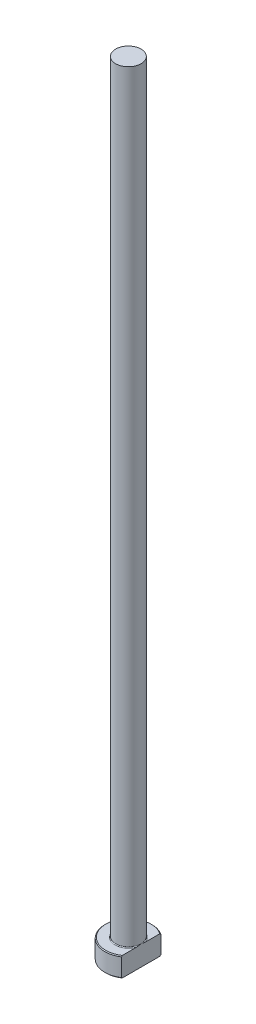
ISO-10303-21;
HEADER;
FILE_DESCRIPTION(('STEP AP214'),'2;1');
FILE_NAME('part.step','',(''),(''),'','','');
FILE_SCHEMA(('AUTOMOTIVE_DESIGN { 1 0 10303 214 1 1 1 1 }'));
ENDSEC;
DATA;
#1=APPLICATION_CONTEXT('core data for automotive mechanical design processes');
#2=APPLICATION_PROTOCOL_DEFINITION('international standard','automotive_design',2000,#1);
#3=PRODUCT_CONTEXT('',#1,'mechanical');
#4=PRODUCT('Part','Part','',(#3));
#5=PRODUCT_RELATED_PRODUCT_CATEGORY('part','',(#4));
#6=PRODUCT_DEFINITION_FORMATION('','',#4);
#7=PRODUCT_DEFINITION_CONTEXT('part definition',#1,'design');
#8=PRODUCT_DEFINITION('design','',#6,#7);
#9=PRODUCT_DEFINITION_SHAPE('','',#8);
#10=(LENGTH_UNIT() NAMED_UNIT(*) SI_UNIT(.MILLI.,.METRE.));
#11=(NAMED_UNIT(*) PLANE_ANGLE_UNIT() SI_UNIT($,.RADIAN.));
#12=(NAMED_UNIT(*) SI_UNIT($,.STERADIAN.) SOLID_ANGLE_UNIT());
#13=UNCERTAINTY_MEASURE_WITH_UNIT(LENGTH_MEASURE(1.E-05),#10,'distance_accuracy_value','');
#14=(GEOMETRIC_REPRESENTATION_CONTEXT(3) GLOBAL_UNCERTAINTY_ASSIGNED_CONTEXT((#13)) GLOBAL_UNIT_ASSIGNED_CONTEXT((#10,
#11,#12)) REPRESENTATION_CONTEXT('',''));
#15=CARTESIAN_POINT('',(0.,0.,0.));
#16=DIRECTION('',(0.,0.,1.));
#17=DIRECTION('',(1.,0.,0.));
#18=AXIS2_PLACEMENT_3D('',#15,#16,#17);
#19=CARTESIAN_POINT('',(0.,0.,0.));
#20=DIRECTION('',(0.,-1.,0.));
#21=DIRECTION('',(0.,0.,-1.));
#22=AXIS2_PLACEMENT_3D('',#19,#20,#21);
#23=PLANE('',#22);
#24=CARTESIAN_POINT('',(0.,0.,0.));
#25=DIRECTION('',(0.,-1.,0.));
#26=DIRECTION('',(0.,0.,-1.));
#27=AXIS2_PLACEMENT_3D('',#24,#25,#26);
#28=CIRCLE('',#27,5.79999999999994);
#29=CARTESIAN_POINT('',(3.24999999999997,0.,4.80390466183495));
#30=VERTEX_POINT('',#29);
#31=CARTESIAN_POINT('',(3.24999999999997,0.,-4.80390466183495));
#32=VERTEX_POINT('',#31);
#33=EDGE_CURVE('E98',#30,#32,#28,.T.);
#34=ORIENTED_EDGE('',*,*,#33,.T.);
#35=DIRECTION('',(0.,0.,1.));
#36=VECTOR('',#35,1.);
#37=CARTESIAN_POINT('',(3.24999999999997,0.,-5.04356025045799));
#38=LINE('',#37,#36);
#39=EDGE_CURVE('E83',#32,#30,#38,.T.);
#40=ORIENTED_EDGE('',*,*,#39,.T.);
#41=EDGE_LOOP('',(#34,#40));
#42=FACE_BOUND('',#41,.T.);
#43=ADVANCED_FACE('F32',(#42),#23,.T.);
#44=CARTESIAN_POINT('',(0.,259.958771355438,0.));
#45=DIRECTION('',(0.,1.,0.));
#46=DIRECTION('',(0.,0.,1.));
#47=AXIS2_PLACEMENT_3D('',#44,#45,#46);
#48=CYLINDRICAL_SURFACE('',#47,5.99999999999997);
#49=CARTESIAN_POINT('',(0.,4.80000000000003,0.));
#50=DIRECTION('',(0.,1.,0.));
#51=DIRECTION('',(0.,0.,1.));
#52=AXIS2_PLACEMENT_3D('',#49,#50,#51);
#53=CIRCLE('',#52,5.99999999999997);
#54=CARTESIAN_POINT('',(3.24999999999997,4.80000000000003,5.04356025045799));
#55=VERTEX_POINT('',#54);
#56=CARTESIAN_POINT('',(3.24999999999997,4.80000000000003,-5.04356025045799));
#57=VERTEX_POINT('',#56);
#58=EDGE_CURVE('E104',#55,#57,#53,.F.);
#59=ORIENTED_EDGE('',*,*,#58,.T.);
#60=DIRECTION('',(0.,-1.,0.));
#61=VECTOR('',#60,1.);
#62=CARTESIAN_POINT('',(3.24999999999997,200.,-5.04356025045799));
#63=LINE('',#62,#61);
#64=CARTESIAN_POINT('',(3.24999999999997,0.200000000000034,-5.04356025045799));
#65=VERTEX_POINT('',#64);
#66=EDGE_CURVE('E183',#57,#65,#63,.T.);
#67=ORIENTED_EDGE('',*,*,#66,.T.);
#68=CARTESIAN_POINT('',(0.,0.200000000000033,0.));
#69=DIRECTION('',(0.,-1.,0.));
#70=DIRECTION('',(0.,0.,-1.));
#71=AXIS2_PLACEMENT_3D('',#68,#69,#70);
#72=CIRCLE('',#71,5.99999999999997);
#73=CARTESIAN_POINT('',(3.24999999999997,0.200000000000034,5.04356025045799));
#74=VERTEX_POINT('',#73);
#75=EDGE_CURVE('E100',#65,#74,#72,.F.);
#76=ORIENTED_EDGE('',*,*,#75,.T.);
#77=DIRECTION('',(0.,-1.,0.));
#78=VECTOR('',#77,1.);
#79=CARTESIAN_POINT('',(3.24999999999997,200.,5.04356025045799));
#80=LINE('',#79,#78);
#81=EDGE_CURVE('E93',#55,#74,#80,.T.);
#82=ORIENTED_EDGE('',*,*,#81,.F.);
#83=EDGE_LOOP('',(#59,#67,#76,#82));
#84=FACE_BOUND('',#83,.T.);
#85=ADVANCED_FACE('F158',(#84),#48,.T.);
#86=CARTESIAN_POINT('',(-5.99999999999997,5.,0.));
#87=DIRECTION('',(0.,1.,0.));
#88=DIRECTION('',(0.,0.,1.));
#89=AXIS2_PLACEMENT_3D('',#86,#87,#88);
#90=PLANE('',#89);
#91=CARTESIAN_POINT('',(0.,5.,0.));
#92=DIRECTION('',(0.,1.,0.));
#93=DIRECTION('',(0.,0.,1.));
#94=AXIS2_PLACEMENT_3D('',#91,#92,#93);
#95=CIRCLE('',#94,5.79999999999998);
#96=CARTESIAN_POINT('',(3.24999999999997,5.,-4.80390466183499));
#97=VERTEX_POINT('',#96);
#98=CARTESIAN_POINT('',(3.24999999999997,5.,4.80390466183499));
#99=VERTEX_POINT('',#98);
#100=EDGE_CURVE('E178',#97,#99,#95,.T.);
#101=ORIENTED_EDGE('',*,*,#100,.T.);
#102=DIRECTION('',(0.,0.,-1.));
#103=VECTOR('',#102,1.);
#104=CARTESIAN_POINT('',(3.24999999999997,5.,0.));
#105=LINE('',#104,#103);
#106=CARTESIAN_POINT('',(3.24999999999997,4.99999999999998,1.15758369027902));
#107=VERTEX_POINT('',#106);
#108=EDGE_CURVE('E57',#99,#107,#105,.T.);
#109=ORIENTED_EDGE('',*,*,#108,.T.);
#110=CARTESIAN_POINT('',(0.,5.,0.));
#111=DIRECTION('',(0.,1.,0.));
#112=DIRECTION('',(0.,0.,1.));
#113=AXIS2_PLACEMENT_3D('',#110,#111,#112);
#114=CIRCLE('',#113,3.44999999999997);
#115=CARTESIAN_POINT('',(3.24999999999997,4.99999999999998,-1.15758369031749));
#116=VERTEX_POINT('',#115);
#117=EDGE_CURVE('E107',#107,#116,#114,.F.);
#118=ORIENTED_EDGE('',*,*,#117,.T.);
#119=EDGE_CURVE('E136',#116,#97,#105,.T.);
#120=ORIENTED_EDGE('',*,*,#119,.T.);
#121=EDGE_LOOP('',(#101,#109,#118,#120));
#122=FACE_BOUND('',#121,.T.);
#123=ADVANCED_FACE('F147',(#122),#90,.T.);
#124=CARTESIAN_POINT('',(0.,5.,0.));
#125=DIRECTION('',(0.,-1.,0.));
#126=DIRECTION('',(0.,0.,-1.));
#127=AXIS2_PLACEMENT_3D('',#124,#125,#126);
#128=CONICAL_SURFACE('',#127,5.79999999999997,0.785398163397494);
#129=ORIENTED_EDGE('',*,*,#58,.F.);
#130=CARTESIAN_POINT('',(3.24999999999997,-0.763340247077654,11.097222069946));
#131=CARTESIAN_POINT('',(3.24999999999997,-0.555249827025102,10.8803821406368));
#132=CARTESIAN_POINT('',(3.24999999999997,-0.347401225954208,10.6633095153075));
#133=CARTESIAN_POINT('',(3.24999999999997,0.0676973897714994,10.2285893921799));
#134=CARTESIAN_POINT('',(3.24999999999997,0.274947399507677,10.010941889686));
#135=CARTESIAN_POINT('',(3.24999999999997,0.68879015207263,9.5749031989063));
#136=CARTESIAN_POINT('',(3.24999999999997,0.895382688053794,9.35651181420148));
#137=CARTESIAN_POINT('',(3.24999999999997,1.30769007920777,8.91890298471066));
#138=CARTESIAN_POINT('',(3.24999999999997,1.51340493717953,8.69968554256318));
#139=CARTESIAN_POINT('',(3.24999999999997,1.92056067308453,8.26365159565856));
#140=CARTESIAN_POINT('',(3.24999999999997,2.1220182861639,8.04685072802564));
#141=CARTESIAN_POINT('',(3.24999999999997,2.52361432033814,7.61203089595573));
#142=CARTESIAN_POINT('',(3.24999999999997,2.72375274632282,7.39401193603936));
#143=CARTESIAN_POINT('',(3.24999999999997,3.1223203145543,6.95646589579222));
#144=CARTESIAN_POINT('',(3.24999999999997,3.32074966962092,6.73693900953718));
#145=CARTESIAN_POINT('',(3.24999999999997,3.71541049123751,6.2959206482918));
#146=CARTESIAN_POINT('',(3.24999999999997,3.91164199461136,6.07442920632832));
#147=CARTESIAN_POINT('',(3.24999999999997,4.26795525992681,5.66684646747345));
#148=CARTESIAN_POINT('',(3.24999999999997,4.42849662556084,5.48115751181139));
#149=CARTESIAN_POINT('',(3.24999999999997,4.74694681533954,5.10749706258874));
#150=CARTESIAN_POINT('',(3.24999999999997,4.9048553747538,4.91952534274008));
#151=CARTESIAN_POINT('',(3.24999999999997,5.21865243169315,4.53879767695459));
#152=CARTESIAN_POINT('',(3.24999999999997,5.37450606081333,4.34601291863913));
#153=CARTESIAN_POINT('',(3.24999999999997,5.68118935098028,3.95653844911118));
#154=CARTESIAN_POINT('',(3.24999999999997,5.83202036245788,3.75984981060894));
#155=CARTESIAN_POINT('',(3.24999999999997,6.05390638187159,3.4594085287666));
#156=CARTESIAN_POINT('',(3.24999999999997,6.12763821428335,3.35763377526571));
#157=CARTESIAN_POINT('',(3.24999999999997,6.27282302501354,3.15247478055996));
#158=CARTESIAN_POINT('',(3.24999999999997,6.3442761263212,3.04909062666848));
#159=CARTESIAN_POINT('',(3.24999999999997,6.48448981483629,2.84026816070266));
#160=CARTESIAN_POINT('',(3.24999999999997,6.55324599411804,2.7348268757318));
#161=CARTESIAN_POINT('',(3.24999999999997,6.68723865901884,2.52174014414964));
#162=CARTESIAN_POINT('',(3.24999999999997,6.75247550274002,2.4140949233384));
#163=CARTESIAN_POINT('',(3.24999999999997,6.87780644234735,2.19745654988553));
#164=CARTESIAN_POINT('',(3.24999999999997,6.93795082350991,2.08849289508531));
#165=CARTESIAN_POINT('',(3.24999999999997,7.05273719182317,1.86772106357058));
#166=CARTESIAN_POINT('',(3.24999999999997,7.10737807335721,1.75591232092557));
#167=CARTESIAN_POINT('',(3.24999999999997,7.26056715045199,1.41626442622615));
#168=CARTESIAN_POINT('',(3.24999999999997,7.34888232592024,1.1833811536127));
#169=CARTESIAN_POINT('',(3.24999999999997,7.44593218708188,0.835575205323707));
#170=CARTESIAN_POINT('',(3.24999999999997,7.4718222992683,0.725406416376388));
#171=CARTESIAN_POINT('',(3.24999999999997,7.51310579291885,0.5030789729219));
#172=CARTESIAN_POINT('',(3.24999999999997,7.52850034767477,0.390920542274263));
#173=CARTESIAN_POINT('',(3.24999999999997,7.54767882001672,0.166070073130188));
#174=CARTESIAN_POINT('',(3.24999999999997,7.5515109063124,0.0533822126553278));
#175=CARTESIAN_POINT('',(3.24999999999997,7.54741082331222,-0.171782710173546));
#176=CARTESIAN_POINT('',(3.24999999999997,7.5394779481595,-0.28425975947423));
#177=CARTESIAN_POINT('',(3.24999999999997,7.51253523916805,-0.507025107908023));
#178=CARTESIAN_POINT('',(3.24999999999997,7.4936058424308,-0.617323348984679));
#179=CARTESIAN_POINT('',(3.24999999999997,7.44595440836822,-0.835762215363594));
#180=CARTESIAN_POINT('',(3.24999999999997,7.41723093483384,-0.943902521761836));
#181=CARTESIAN_POINT('',(3.24999999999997,7.35127840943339,-1.15830231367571));
#182=CARTESIAN_POINT('',(3.24999999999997,7.31399439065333,-1.26454464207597));
#183=CARTESIAN_POINT('',(3.24999999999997,7.23254630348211,-1.47430332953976));
#184=CARTESIAN_POINT('',(3.24999999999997,7.18838353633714,-1.57782019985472));
#185=CARTESIAN_POINT('',(3.24999999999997,7.09672451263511,-1.7774238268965));
#186=CARTESIAN_POINT('',(3.24999999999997,7.04948595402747,-1.87363004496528));
#187=CARTESIAN_POINT('',(3.24999999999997,6.95089019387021,-2.06391775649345));
#188=CARTESIAN_POINT('',(3.24999999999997,6.89953216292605,-2.15799881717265));
#189=CARTESIAN_POINT('',(3.24999999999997,6.74036914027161,-2.43755985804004));
#190=CARTESIAN_POINT('',(3.24999999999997,6.62755752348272,-2.62018561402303));
#191=CARTESIAN_POINT('',(3.24999999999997,6.39256809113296,-2.98019331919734));
#192=CARTESIAN_POINT('',(3.24999999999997,6.27035601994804,-3.15755247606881));
#193=CARTESIAN_POINT('',(3.24999999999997,6.0197011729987,-3.50765833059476));
#194=CARTESIAN_POINT('',(3.24999999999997,5.8912614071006,-3.68040719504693));
#195=CARTESIAN_POINT('',(3.24999999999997,5.62829316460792,-4.02448614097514));
#196=CARTESIAN_POINT('',(3.24999999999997,5.49371006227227,-4.19577421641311));
#197=CARTESIAN_POINT('',(3.24999999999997,5.22110967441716,-4.5356145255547));
#198=CARTESIAN_POINT('',(3.24999999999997,5.08309204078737,-4.70416647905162));
#199=CARTESIAN_POINT('',(3.24999999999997,4.80478673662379,-5.03871726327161));
#200=CARTESIAN_POINT('',(3.24999999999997,4.66450509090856,-5.20472111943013));
#201=CARTESIAN_POINT('',(3.24999999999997,4.38193422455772,-5.53501285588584));
#202=CARTESIAN_POINT('',(3.24999999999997,4.23964496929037,-5.69930070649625));
#203=CARTESIAN_POINT('',(3.24999999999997,3.89726045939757,-6.09077577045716));
#204=CARTESIAN_POINT('',(3.24999999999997,3.69642117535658,-6.31731165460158));
#205=CARTESIAN_POINT('',(3.24999999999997,3.29246897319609,-6.76834962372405));
#206=CARTESIAN_POINT('',(3.24999999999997,3.08935601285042,-6.99285167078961));
#207=CARTESIAN_POINT('',(3.24999999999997,2.68122553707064,-7.44046009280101));
#208=CARTESIAN_POINT('',(3.24999999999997,2.47620657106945,-7.66356514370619));
#209=CARTESIAN_POINT('',(3.24999999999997,2.06481442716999,-8.10852300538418));
#210=CARTESIAN_POINT('',(3.24999999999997,1.85844124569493,-8.33037581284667));
#211=CARTESIAN_POINT('',(3.24999999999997,1.45176082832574,-8.76543407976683));
#212=CARTESIAN_POINT('',(3.24999999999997,1.25149010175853,-8.9786736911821));
#213=CARTESIAN_POINT('',(3.24999999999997,0.850131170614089,-9.40438299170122));
#214=CARTESIAN_POINT('',(3.24999999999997,0.649042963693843,-9.61685267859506));
#215=CARTESIAN_POINT('',(3.24999999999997,0.246391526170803,-10.0409455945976));
#216=CARTESIAN_POINT('',(3.24999999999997,0.0448289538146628,-10.2525694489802));
#217=CARTESIAN_POINT('',(3.24999999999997,-0.358859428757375,-10.6752763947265));
#218=CARTESIAN_POINT('',(3.24999999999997,-0.560985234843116,-10.8863594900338));
#219=CARTESIAN_POINT('',(3.24999999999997,-0.763340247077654,-11.097222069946));
#220=B_SPLINE_CURVE_WITH_KNOTS('',3,(#130,#131,#132,#133,#134,#135,#136,#137,#138,#139,#140,
#141,#142,#143,#144,#145,#146,#147,#148,#149,#150,#151,#152,#153,#154,#155,#156,#157,#158,#159,
#160,#161,#162,#163,#164,#165,#166,#167,#168,#169,#170,#171,#172,#173,#174,#175,#176,#177,#178,
#179,#180,#181,#182,#183,#184,#185,#186,#187,#188,#189,#190,#191,#192,#193,#194,#195,#196,#197,
#198,#199,#200,#201,#202,#203,#204,#205,#206,#207,#208,#209,#210,#211,#212,#213,#214,#215,#216,
#217,#218,#219),.UNSPECIFIED.,.F.,.F.,(4,2,2,2,2,2,2,2,2,2,2,2,2,2,2,2,2,2,2,2,2,2,2,2,2,2,2,2,
2,2,2,2,2,2,2,2,2,2,2,2,2,2,2,2,4),(0.,0.901604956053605,1.80321729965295,2.70508973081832,
3.60695928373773,4.49481204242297,5.3826615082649,6.27039876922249,7.15812113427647,
7.89450333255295,8.63095913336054,9.37461869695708,10.1180766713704,10.4950808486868,
10.8720646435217,11.2496408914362,11.6271786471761,12.0003984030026,12.3736929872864,
13.117405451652,13.4565058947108,13.795568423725,14.1332164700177,14.4708847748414,
14.8061136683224,15.1413917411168,15.4788860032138,15.8163164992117,16.1377318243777,
16.4592120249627,17.1027431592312,17.7487418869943,18.3944314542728,19.0478814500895,
19.7013979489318,20.3533948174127,21.0054029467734,21.9136176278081,22.8218492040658,
23.7308402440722,24.6398336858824,25.5174503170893,26.3950694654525,27.2718289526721,
28.1485820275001),.UNSPECIFIED.);
#221=EDGE_CURVE('E135',#55,#99,#220,.T.);
#222=ORIENTED_EDGE('',*,*,#221,.T.);
#223=ORIENTED_EDGE('',*,*,#100,.F.);
#224=EDGE_CURVE('E127',#97,#57,#220,.T.);
#225=ORIENTED_EDGE('',*,*,#224,.T.);
#226=EDGE_LOOP('',(#129,#222,#223,#225));
#227=FACE_BOUND('',#226,.T.);
#228=ADVANCED_FACE('F143',(#227),#128,.T.);
#229=CARTESIAN_POINT('',(0.,0.200000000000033,0.));
#230=DIRECTION('',(0.,1.,0.));
#231=DIRECTION('',(0.,0.,1.));
#232=AXIS2_PLACEMENT_3D('',#229,#230,#231);
#233=CONICAL_SURFACE('',#232,5.99999999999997,0.785398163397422);
#234=ORIENTED_EDGE('',*,*,#75,.F.);
#235=CARTESIAN_POINT('',(3.24999999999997,5.76334024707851,-11.0972220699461));
#236=CARTESIAN_POINT('',(3.24999999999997,5.55524982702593,-10.8803821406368));
#237=CARTESIAN_POINT('',(3.24999999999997,5.347401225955,-10.6633095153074));
#238=CARTESIAN_POINT('',(3.24999999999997,4.93230261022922,-10.2285893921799));
#239=CARTESIAN_POINT('',(3.24999999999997,4.72505260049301,-10.0109418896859));
#240=CARTESIAN_POINT('',(3.24999999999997,4.31120984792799,-9.57490319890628));
#241=CARTESIAN_POINT('',(3.24999999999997,4.10461731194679,-9.35651181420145));
#242=CARTESIAN_POINT('',(3.24999999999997,3.69230992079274,-8.91890298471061));
#243=CARTESIAN_POINT('',(3.24999999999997,3.48659506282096,-8.69968554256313));
#244=CARTESIAN_POINT('',(3.24999999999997,3.07943932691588,-8.26365159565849));
#245=CARTESIAN_POINT('',(3.24999999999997,2.87798171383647,-8.04685072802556));
#246=CARTESIAN_POINT('',(3.24999999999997,2.47638567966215,-7.61203089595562));
#247=CARTESIAN_POINT('',(3.24999999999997,2.27624725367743,-7.39401193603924));
#248=CARTESIAN_POINT('',(3.24999999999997,1.87767968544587,-6.95646589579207));
#249=CARTESIAN_POINT('',(3.24999999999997,1.6792503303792,-6.73693900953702));
#250=CARTESIAN_POINT('',(3.24999999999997,1.28458950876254,-6.29592064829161));
#251=CARTESIAN_POINT('',(3.24999999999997,1.08835800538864,-6.07442920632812));
#252=CARTESIAN_POINT('',(3.24999999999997,0.732044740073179,-5.66684646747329));
#253=CARTESIAN_POINT('',(3.24999999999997,0.57150337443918,-5.48115751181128));
#254=CARTESIAN_POINT('',(3.24999999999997,0.253053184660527,-5.10749706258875));
#255=CARTESIAN_POINT('',(3.24999999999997,0.0951446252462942,-4.91952534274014));
#256=CARTESIAN_POINT('',(3.24999999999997,-0.218652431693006,-4.53879767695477));
#257=CARTESIAN_POINT('',(3.24999999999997,-0.374506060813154,-4.34601291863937));
#258=CARTESIAN_POINT('',(3.24999999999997,-0.681189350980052,-3.95653844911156));
#259=CARTESIAN_POINT('',(3.24999999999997,-0.832020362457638,-3.75984981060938));
#260=CARTESIAN_POINT('',(3.24999999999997,-1.05390638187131,-3.45940852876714));
#261=CARTESIAN_POINT('',(3.24999999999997,-1.12763821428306,-3.35763377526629));
#262=CARTESIAN_POINT('',(3.24999999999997,-1.27282302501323,-3.15247478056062));
#263=CARTESIAN_POINT('',(3.24999999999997,-1.34427612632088,-3.04909062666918));
#264=CARTESIAN_POINT('',(3.24999999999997,-1.48448981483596,-2.84026816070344));
#265=CARTESIAN_POINT('',(3.24999999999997,-1.5532459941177,-2.73482687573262));
#266=CARTESIAN_POINT('',(3.24999999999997,-1.6872386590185,-2.52174014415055));
#267=CARTESIAN_POINT('',(3.24999999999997,-1.75247550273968,-2.41409492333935));
#268=CARTESIAN_POINT('',(3.24999999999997,-1.87780644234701,-2.19745654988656));
#269=CARTESIAN_POINT('',(3.24999999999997,-1.93795082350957,-2.08849289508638));
#270=CARTESIAN_POINT('',(3.24999999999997,-2.05273719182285,-1.86772106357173));
#271=CARTESIAN_POINT('',(3.24999999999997,-2.10737807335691,-1.75591232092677));
#272=CARTESIAN_POINT('',(3.24999999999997,-2.26056715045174,-1.41626442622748));
#273=CARTESIAN_POINT('',(3.24999999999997,-2.34888232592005,-1.18338115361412));
#274=CARTESIAN_POINT('',(3.24999999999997,-2.44593218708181,-0.835575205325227));
#275=CARTESIAN_POINT('',(3.24999999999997,-2.47182229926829,-0.725406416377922));
#276=CARTESIAN_POINT('',(3.24999999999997,-2.51310579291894,-0.50307897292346));
#277=CARTESIAN_POINT('',(3.24999999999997,-2.52850034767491,-0.390920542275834));
#278=CARTESIAN_POINT('',(3.24999999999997,-2.54767882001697,-0.166070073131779));
#279=CARTESIAN_POINT('',(3.24999999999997,-2.5515109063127,-0.0533822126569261));
#280=CARTESIAN_POINT('',(3.24999999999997,-2.54741082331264,0.171782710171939));
#281=CARTESIAN_POINT('',(3.24999999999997,-2.53947794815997,0.284259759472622));
#282=CARTESIAN_POINT('',(3.24999999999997,-2.51253523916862,0.507025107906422));
#283=CARTESIAN_POINT('',(3.24999999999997,-2.49360584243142,0.617323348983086));
#284=CARTESIAN_POINT('',(3.24999999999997,-2.44595440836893,0.835762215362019));
#285=CARTESIAN_POINT('',(3.24999999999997,-2.41723093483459,0.943902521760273));
#286=CARTESIAN_POINT('',(3.24999999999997,-2.35127840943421,1.15830231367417));
#287=CARTESIAN_POINT('',(3.24999999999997,-2.31399439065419,1.26454464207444));
#288=CARTESIAN_POINT('',(3.24999999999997,-2.23254630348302,1.47430332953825));
#289=CARTESIAN_POINT('',(3.24999999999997,-2.18838353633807,1.57782019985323));
#290=CARTESIAN_POINT('',(3.24999999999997,-2.09672451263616,1.77742382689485));
#291=CARTESIAN_POINT('',(3.24999999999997,-2.04948595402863,1.87363004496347));
#292=CARTESIAN_POINT('',(3.24999999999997,-1.95089019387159,2.06391775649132));
#293=CARTESIAN_POINT('',(3.24999999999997,-1.89953216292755,2.15799881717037));
#294=CARTESIAN_POINT('',(3.24999999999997,-1.74036914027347,2.4375598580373));
#295=CARTESIAN_POINT('',(3.24999999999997,-1.62755752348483,2.62018561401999));
#296=CARTESIAN_POINT('',(3.24999999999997,-1.39256809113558,2.98019331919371));
#297=CARTESIAN_POINT('',(3.24999999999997,-1.27035601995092,3.15755247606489));
#298=CARTESIAN_POINT('',(3.24999999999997,-1.01970117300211,3.50765833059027));
#299=CARTESIAN_POINT('',(3.24999999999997,-0.891261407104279,3.68040719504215));
#300=CARTESIAN_POINT('',(3.24999999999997,-0.628293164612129,4.0244861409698));
#301=CARTESIAN_POINT('',(3.24999999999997,-0.493710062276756,4.19577421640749));
#302=CARTESIAN_POINT('',(3.24999999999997,-0.221109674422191,4.53561452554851));
#303=CARTESIAN_POINT('',(3.24999999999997,-0.0830920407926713,4.70416647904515));
#304=CARTESIAN_POINT('',(3.24999999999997,0.19521326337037,5.03871726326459));
#305=CARTESIAN_POINT('',(3.24999999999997,0.335494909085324,5.20472111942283));
#306=CARTESIAN_POINT('',(3.24999999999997,0.618065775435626,5.53501285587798));
#307=CARTESIAN_POINT('',(3.24999999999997,0.7603550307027,5.69930070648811));
#308=CARTESIAN_POINT('',(3.24999999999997,1.10273954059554,6.09077577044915));
#309=CARTESIAN_POINT('',(3.24999999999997,1.30357882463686,6.31731165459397));
#310=CARTESIAN_POINT('',(3.24999999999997,1.70753102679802,6.76834962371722));
#311=CARTESIAN_POINT('',(3.24999999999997,1.91064398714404,6.99285167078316));
#312=CARTESIAN_POINT('',(3.24999999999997,2.31877446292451,7.44046009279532));
#313=CARTESIAN_POINT('',(3.24999999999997,2.52379342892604,7.66356514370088));
#314=CARTESIAN_POINT('',(3.24999999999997,2.93518557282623,8.10852300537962));
#315=CARTESIAN_POINT('',(3.24999999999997,3.14155875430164,8.33037581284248));
#316=CARTESIAN_POINT('',(3.24999999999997,3.54823917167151,8.76543407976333));
#317=CARTESIAN_POINT('',(3.24999999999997,3.74850989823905,8.97867369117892));
#318=CARTESIAN_POINT('',(3.24999999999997,4.14986882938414,9.40438299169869));
#319=CARTESIAN_POINT('',(3.24999999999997,4.35095703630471,9.61685267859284));
#320=CARTESIAN_POINT('',(3.24999999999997,4.75360847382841,10.040945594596));
#321=CARTESIAN_POINT('',(3.24999999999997,4.95517104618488,10.252569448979));
#322=CARTESIAN_POINT('',(3.24999999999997,5.35885942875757,10.6752763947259));
#323=CARTESIAN_POINT('',(3.24999999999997,5.56098523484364,10.8863594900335));
#324=CARTESIAN_POINT('',(3.24999999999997,5.76334024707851,11.097222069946));
#325=B_SPLINE_CURVE_WITH_KNOTS('',3,(#235,#236,#237,#238,#239,#240,#241,#242,#243,#244,#245,
#246,#247,#248,#249,#250,#251,#252,#253,#254,#255,#256,#257,#258,#259,#260,#261,#262,#263,#264,
#265,#266,#267,#268,#269,#270,#271,#272,#273,#274,#275,#276,#277,#278,#279,#280,#281,#282,#283,
#284,#285,#286,#287,#288,#289,#290,#291,#292,#293,#294,#295,#296,#297,#298,#299,#300,#301,#302,
#303,#304,#305,#306,#307,#308,#309,#310,#311,#312,#313,#314,#315,#316,#317,#318,#319,#320,#321,
#322,#323,#324),.UNSPECIFIED.,.F.,.F.,(4,2,2,2,2,2,2,2,2,2,2,2,2,2,2,2,2,2,2,2,2,2,2,2,2,2,2,2,
2,2,2,2,2,2,2,2,2,2,2,2,2,2,2,2,4),(0.,0.901604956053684,1.80321729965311,2.70508973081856,
3.60695928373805,4.4948120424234,5.38266150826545,6.27039876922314,7.15812113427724,
7.89450333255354,8.63095913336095,9.3746186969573,10.1180766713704,10.4950808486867,
10.8720646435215,11.2496408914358,11.6271786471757,12.000398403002,12.3736929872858,
13.1174054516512,13.4565058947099,13.7955684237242,14.1332164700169,14.4708847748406,
14.8061136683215,15.1413917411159,15.478886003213,15.8163164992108,16.1377318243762,
16.4592120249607,17.1027431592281,17.74874188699,18.3944314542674,19.0478814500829,
19.701397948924,20.3533948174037,21.0054029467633,21.9136176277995,22.8218492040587,
23.7308402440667,24.6398336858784,25.5174503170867,26.3950694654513,27.2718289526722,
28.1485820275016),.UNSPECIFIED.);
#326=EDGE_CURVE('E86',#65,#32,#325,.T.);
#327=ORIENTED_EDGE('',*,*,#326,.T.);
#328=ORIENTED_EDGE('',*,*,#33,.F.);
#329=EDGE_CURVE('E89',#30,#74,#325,.T.);
#330=ORIENTED_EDGE('',*,*,#329,.T.);
#331=EDGE_LOOP('',(#234,#327,#328,#330));
#332=FACE_BOUND('',#331,.T.);
#333=ADVANCED_FACE('F97',(#332),#233,.T.);
#334=CARTESIAN_POINT('',(0.,5.19999999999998,0.));
#335=DIRECTION('',(0.,1.,0.));
#336=DIRECTION('',(0.,0.,1.));
#337=AXIS2_PLACEMENT_3D('',#334,#335,#336);
#338=TOROIDAL_SURFACE('',#337,3.44999999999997,0.2);
#339=CARTESIAN_POINT('',(3.24999999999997,5.19999999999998,0.));
#340=CARTESIAN_POINT('',(3.24999999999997,5.20000050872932,1.30593484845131E-10));
#341=CARTESIAN_POINT('',(3.24999999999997,5.20000101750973,-2.02989018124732E-07));
#342=CARTESIAN_POINT('',(3.24999999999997,5.20000196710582,-7.62846146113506E-07));
#343=CARTESIAN_POINT('',(3.24999999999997,5.20000239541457,-1.13332165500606E-06));
#344=CARTESIAN_POINT('',(3.24999999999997,5.20000328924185,-2.02149564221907E-06));
#345=CARTESIAN_POINT('',(3.24999999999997,5.20000374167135,-2.55359112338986E-06));
#346=CARTESIAN_POINT('',(3.24999999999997,5.20000454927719,-3.65434903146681E-06));
#347=CARTESIAN_POINT('',(3.24999999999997,5.20000490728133,-4.22110424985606E-06));
#348=CARTESIAN_POINT('',(3.24999999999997,5.20000624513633,-6.42540895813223E-06));
#349=CARTESIAN_POINT('',(3.24999999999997,5.20000715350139,-8.1091236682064E-06));
#350=CARTESIAN_POINT('',(3.24999999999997,5.20000863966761,-1.14364149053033E-05));
#351=CARTESIAN_POINT('',(3.24999999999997,5.20000923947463,-1.30705587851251E-05));
#352=CARTESIAN_POINT('',(3.24999999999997,5.20001177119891,-2.00139280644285E-05));
#353=CARTESIAN_POINT('',(3.24999999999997,5.20001367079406,-2.53379428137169E-05));
#354=CARTESIAN_POINT('',(3.24999999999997,5.20001645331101,-3.53765138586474E-05));
#355=CARTESIAN_POINT('',(3.24999999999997,5.20001744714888,-4.00600779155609E-05));
#356=CARTESIAN_POINT('',(3.24999999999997,5.20002471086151,-7.49504389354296E-05));
#357=CARTESIAN_POINT('',(3.24999999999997,5.20003024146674,-0.00010526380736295));
#358=CARTESIAN_POINT('',(3.24999999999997,5.20005445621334,-0.00022532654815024));
#359=CARTESIAN_POINT('',(3.24999999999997,5.20007753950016,-0.000314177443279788));
#360=CARTESIAN_POINT('',(3.24999999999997,5.20016768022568,-0.000666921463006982));
#361=CARTESIAN_POINT('',(3.24999999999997,5.20023191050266,-0.000931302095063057));
#362=CARTESIAN_POINT('',(3.24999999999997,5.20048969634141,-0.00198463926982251));
#363=CARTESIAN_POINT('',(3.24999999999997,5.20068683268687,-0.0027729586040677));
#364=CARTESIAN_POINT('',(3.24999999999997,5.20150726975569,-0.00606245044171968));
#365=CARTESIAN_POINT('',(3.24999999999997,5.20212605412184,-0.00856442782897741));
#366=CARTESIAN_POINT('',(3.24999999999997,5.20719838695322,-0.0290628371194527));
#367=CARTESIAN_POINT('',(3.24999999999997,5.21166800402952,-0.0470565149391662));
#368=CARTESIAN_POINT('',(3.24999999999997,5.22040162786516,-0.0823313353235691));
#369=CARTESIAN_POINT('',(3.24999999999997,5.22466671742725,-0.0996122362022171));
#370=CARTESIAN_POINT('',(3.24999999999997,5.23855308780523,-0.156076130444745));
#371=CARTESIAN_POINT('',(3.24999999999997,5.24811538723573,-0.195273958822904));
#372=CARTESIAN_POINT('',(3.24999999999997,5.26421029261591,-0.262424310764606));
#373=CARTESIAN_POINT('',(3.24999999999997,5.27082096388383,-0.290358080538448));
#374=CARTESIAN_POINT('',(3.24999999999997,5.28365202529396,-0.345539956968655));
#375=CARTESIAN_POINT('',(3.24999999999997,5.28987810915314,-0.3727867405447));
#376=CARTESIAN_POINT('',(3.24999999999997,5.30721519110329,-0.45039737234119));
#377=CARTESIAN_POINT('',(3.24999999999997,5.31800675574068,-0.500833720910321));
#378=CARTESIAN_POINT('',(3.24999999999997,5.33836987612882,-0.60242326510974));
#379=CARTESIAN_POINT('',(3.24999999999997,5.34792968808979,-0.653578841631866));
#380=CARTESIAN_POINT('',(3.24999999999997,5.36597954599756,-0.760718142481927));
#381=CARTESIAN_POINT('',(3.24999999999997,5.37430170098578,-0.81673101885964));
#382=CARTESIAN_POINT('',(3.24999999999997,5.38793579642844,-0.928977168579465));
#383=CARTESIAN_POINT('',(3.24999999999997,5.39325594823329,-0.985209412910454));
#384=CARTESIAN_POINT('',(3.24999999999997,5.39967715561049,-1.09627192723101));
#385=CARTESIAN_POINT('',(3.24999999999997,5.40090002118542,-1.15109363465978));
#386=CARTESIAN_POINT('',(3.24999999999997,5.39854105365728,-1.23278196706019));
#387=CARTESIAN_POINT('',(3.24999999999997,5.397083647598,-1.25970835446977));
#388=CARTESIAN_POINT('',(3.24999999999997,5.39248016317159,-1.31340846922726));
#389=CARTESIAN_POINT('',(3.24999999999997,5.38933527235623,-1.34018229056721));
#390=CARTESIAN_POINT('',(3.24999999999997,5.38085808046,-1.39365539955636));
#391=CARTESIAN_POINT('',(3.24999999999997,5.37550486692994,-1.42035144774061));
#392=CARTESIAN_POINT('',(3.24999999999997,5.36186683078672,-1.47304562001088));
#393=CARTESIAN_POINT('',(3.24999999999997,5.35358306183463,-1.49904399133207));
#394=CARTESIAN_POINT('',(3.24999999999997,5.33840624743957,-1.53566403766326));
#395=CARTESIAN_POINT('',(3.24999999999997,5.33319528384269,-1.54697847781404));
#396=CARTESIAN_POINT('',(3.24999999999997,5.32165705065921,-1.56904809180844));
#397=CARTESIAN_POINT('',(3.24999999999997,5.31532920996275,-1.57980297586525));
#398=CARTESIAN_POINT('',(3.24999999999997,5.30232638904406,-1.5988624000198));
#399=CARTESIAN_POINT('',(3.24999999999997,5.2958406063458,-1.60729427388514));
#400=CARTESIAN_POINT('',(3.24999999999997,5.28165581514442,-1.62307272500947));
#401=CARTESIAN_POINT('',(3.24999999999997,5.2739607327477,-1.63042267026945));
#402=CARTESIAN_POINT('',(3.24999999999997,5.26066720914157,-1.64067803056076));
#403=CARTESIAN_POINT('',(3.24999999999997,5.25551950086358,-1.64416379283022));
#404=CARTESIAN_POINT('',(3.24999999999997,5.24475577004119,-1.65032852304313));
#405=CARTESIAN_POINT('',(3.24999999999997,5.23914006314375,-1.65300802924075));
#406=CARTESIAN_POINT('',(3.24999999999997,5.22744494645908,-1.65736207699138));
#407=CARTESIAN_POINT('',(3.24999999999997,5.22136079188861,-1.65902420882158));
#408=CARTESIAN_POINT('',(3.24999999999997,5.20898349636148,-1.66109219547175));
#409=CARTESIAN_POINT('',(3.24999999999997,5.20269065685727,-1.66149978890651));
#410=CARTESIAN_POINT('',(3.24999999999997,5.19107570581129,-1.66104520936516));
#411=CARTESIAN_POINT('',(3.24999999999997,5.18574582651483,-1.66035949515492));
#412=CARTESIAN_POINT('',(3.24999999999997,5.17527668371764,-1.65810570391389));
#413=CARTESIAN_POINT('',(3.24999999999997,5.1701375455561,-1.65653705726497));
#414=CARTESIAN_POINT('',(3.24999999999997,5.15872192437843,-1.65208432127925));
#415=CARTESIAN_POINT('',(3.24999999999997,5.15254320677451,-1.64895170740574));
#416=CARTESIAN_POINT('',(3.24999999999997,5.14076776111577,-1.64173915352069));
#417=CARTESIAN_POINT('',(3.24999999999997,5.13517231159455,-1.63765719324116));
#418=CARTESIAN_POINT('',(3.24999999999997,5.12145239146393,-1.62621801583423));
#419=CARTESIAN_POINT('',(3.24999999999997,5.11376432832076,-1.61834208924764));
#420=CARTESIAN_POINT('',(3.24999999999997,5.09963913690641,-1.6015591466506));
#421=CARTESIAN_POINT('',(3.24999999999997,5.0932043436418,-1.59265025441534));
#422=CARTESIAN_POINT('',(3.24999999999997,5.07579513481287,-1.56554611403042));
#423=CARTESIAN_POINT('',(3.24999999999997,5.06621235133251,-1.54646705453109));
#424=CARTESIAN_POINT('',(3.24999999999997,5.04964498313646,-1.5071324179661));
#425=CARTESIAN_POINT('',(3.24999999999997,5.04268052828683,-1.48686905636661));
#426=CARTESIAN_POINT('',(3.24999999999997,5.02812767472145,-1.43684519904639));
#427=CARTESIAN_POINT('',(3.24999999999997,5.02158372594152,-1.40678481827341));
#428=CARTESIAN_POINT('',(3.24999999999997,5.01134780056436,-1.3461374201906));
#429=CARTESIAN_POINT('',(3.24999999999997,5.00766434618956,-1.31554910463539));
#430=CARTESIAN_POINT('',(3.24999999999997,5.00256038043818,-1.2550900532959));
#431=CARTESIAN_POINT('',(3.24999999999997,5.00107707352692,-1.22522437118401));
#432=CARTESIAN_POINT('',(3.24999999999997,4.99975288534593,-1.16560651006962));
#433=CARTESIAN_POINT('',(3.24999999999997,4.99990422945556,-1.13585446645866));
#434=CARTESIAN_POINT('',(3.24999999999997,5.00180470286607,-1.06636643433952));
#435=CARTESIAN_POINT('',(3.24999999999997,5.00407520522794,-1.02664548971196));
#436=CARTESIAN_POINT('',(3.24999999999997,5.01046283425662,-0.947373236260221));
#437=CARTESIAN_POINT('',(3.24999999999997,5.01457941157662,-0.907821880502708));
#438=CARTESIAN_POINT('',(3.24999999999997,5.02439538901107,-0.827971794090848));
#439=CARTESIAN_POINT('',(3.24999999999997,5.03012984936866,-0.787677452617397));
#440=CARTESIAN_POINT('',(3.24999999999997,5.0428354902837,-0.707180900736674));
#441=CARTESIAN_POINT('',(3.24999999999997,5.04980982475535,-0.666979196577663));
#442=CARTESIAN_POINT('',(3.24999999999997,5.06745383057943,-0.572058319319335));
#443=CARTESIAN_POINT('',(3.24999999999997,5.07854113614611,-0.517417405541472));
#444=CARTESIAN_POINT('',(3.24999999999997,5.10182947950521,-0.409021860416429));
#445=CARTESIAN_POINT('',(3.24999999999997,5.11401657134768,-0.355264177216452));
#446=CARTESIAN_POINT('',(3.24999999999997,5.13769793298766,-0.254099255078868));
#447=CARTESIAN_POINT('',(3.24999999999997,5.14911069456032,-0.206672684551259));
#448=CARTESIAN_POINT('',(3.24999999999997,5.1727713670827,-0.109852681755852));
#449=CARTESIAN_POINT('',(3.24999999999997,5.18503405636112,-0.0604628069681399));
#450=CARTESIAN_POINT('',(3.24999999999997,5.19787537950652,-0.0085581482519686));
#451=CARTESIAN_POINT('',(3.24999999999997,5.19849580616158,-0.00604992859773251));
#452=CARTESIAN_POINT('',(3.24999999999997,5.19931662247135,-0.00275902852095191));
#453=CARTESIAN_POINT('',(3.24999999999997,5.19951254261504,-0.00197555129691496));
#454=CARTESIAN_POINT('',(3.24999999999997,5.1997688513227,-0.000928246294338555));
#455=CARTESIAN_POINT('',(3.24999999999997,5.19983279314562,-0.000665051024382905));
#456=CARTESIAN_POINT('',(3.24999999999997,5.19992258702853,-0.000313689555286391));
#457=CARTESIAN_POINT('',(3.24999999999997,5.19994562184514,-0.000225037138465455));
#458=CARTESIAN_POINT('',(3.24999999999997,5.19996979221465,-0.000105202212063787));
#459=CARTESIAN_POINT('',(3.24999999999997,5.19997531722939,-7.49162835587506E-05));
#460=CARTESIAN_POINT('',(3.24999999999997,5.19998256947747,-4.0053976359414E-05));
#461=CARTESIAN_POINT('',(3.24999999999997,5.1999835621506,-3.53718998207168E-05));
#462=CARTESIAN_POINT('',(3.24999999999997,5.19998634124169,-2.53364128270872E-05));
#463=CARTESIAN_POINT('',(3.24999999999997,5.19998823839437,-2.00139156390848E-05));
#464=CARTESIAN_POINT('',(3.24999999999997,5.19999076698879,-1.30721306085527E-05));
#465=CARTESIAN_POINT('',(3.24999999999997,5.19999136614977,-1.14380977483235E-05));
#466=CARTESIAN_POINT('',(3.24999999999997,5.19999285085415,-8.11092555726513E-06));
#467=CARTESIAN_POINT('',(3.24999999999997,5.19999375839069,-6.42720440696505E-06));
#468=CARTESIAN_POINT('',(3.24999999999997,5.19999509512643,-4.2227718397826E-06));
#469=CARTESIAN_POINT('',(3.24999999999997,5.1999954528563,-3.65594799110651E-06));
#470=CARTESIAN_POINT('',(3.24999999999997,5.19999625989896,-2.55500330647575E-06));
#471=CARTESIAN_POINT('',(3.24999999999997,5.19999671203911,-2.0227876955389E-06));
#472=CARTESIAN_POINT('',(3.24999999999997,5.19999760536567,-1.13433308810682E-06));
#473=CARTESIAN_POINT('',(3.24999999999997,5.19999803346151,-7.63708107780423E-07));
#474=CARTESIAN_POINT('',(3.24999999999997,5.19999898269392,-2.03470796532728E-07));
#475=CARTESIAN_POINT('',(3.24999999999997,5.19999949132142,-1.30580450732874E-10));
#476=CARTESIAN_POINT('',(3.24999999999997,5.19999999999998,0.));
#477=B_SPLINE_CURVE_WITH_KNOTS('',3,(#339,#340,#341,#342,#343,#344,#345,#346,#347,#348,#349,
#350,#351,#352,#353,#354,#355,#356,#357,#358,#359,#360,#361,#362,#363,#364,#365,#366,#367,#368,
#369,#370,#371,#372,#373,#374,#375,#376,#377,#378,#379,#380,#381,#382,#383,#384,#385,#386,#387,
#388,#389,#390,#391,#392,#393,#394,#395,#396,#397,#398,#399,#400,#401,#402,#403,#404,#405,#406,
#407,#408,#409,#410,#411,#412,#413,#414,#415,#416,#417,#418,#419,#420,#421,#422,#423,#424,#425,
#426,#427,#428,#429,#430,#431,#432,#433,#434,#435,#436,#437,#438,#439,#440,#441,#442,#443,#444,
#445,#446,#447,#448,#449,#450,#451,#452,#453,#454,#455,#456,#457,#458,#459,#460,#461,#462,#463,
#464,#465,#466,#467,#468,#469,#470,#471,#472,#473,#474,#475,#476),.UNSPECIFIED.,.T.,.F.,(4,2,2,
2,2,2,2,2,2,2,2,2,2,2,2,2,2,2,2,2,2,2,2,2,2,2,2,2,2,2,2,2,2,2,2,2,2,2,2,2,2,2,2,2,2,2,2,2,2,2,2,
2,2,2,2,2,2,2,2,2,2,2,2,2,2,2,2,2,4),(0.,1.54201220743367E-06,3.24382184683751E-06,
5.32610111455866E-06,7.33619204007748E-06,1.30552971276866E-05,1.82727733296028E-05,
3.52029744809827E-05,4.95493511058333E-05,0.000142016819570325,0.000417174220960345,
0.00123364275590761,0.00367111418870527,0.0114035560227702,0.0670234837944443,0.120422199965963,
0.241463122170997,0.327578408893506,0.411425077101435,0.566146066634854,0.722247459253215,
0.892069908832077,1.06142556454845,1.22569945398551,1.30655828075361,1.38736027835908,
1.46894569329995,1.55050180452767,1.58782892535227,1.62517518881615,1.65700740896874,
1.68873834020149,1.70733388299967,1.72591698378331,1.74472246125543,1.76350186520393,
1.77954337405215,1.79559524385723,1.81626176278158,1.83697267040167,1.86980451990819,
1.90269696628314,1.96639085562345,2.03056487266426,2.12263115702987,2.21497069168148,
2.30462030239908,2.39384371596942,2.51314182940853,2.632404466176,2.75448156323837,
2.8768737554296,3.04411391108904,3.20947099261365,3.35581134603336,3.50847473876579,
3.51622652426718,3.51864902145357,3.5194618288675,3.51973637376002,3.51982875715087,
3.51984309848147,3.51986002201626,3.51986523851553,3.5198709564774,3.51987296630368,
3.51987504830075,3.51987674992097,3.51987829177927),.UNSPECIFIED.);
#478=CARTESIAN_POINT('',(3.24999999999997,5.19999999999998,0.));
#479=VERTEX_POINT('',#478);
#480=EDGE_CURVE('E11',#116,#479,#477,.T.);
#481=ORIENTED_EDGE('',*,*,#480,.F.);
#482=ORIENTED_EDGE('',*,*,#117,.F.);
#483=CARTESIAN_POINT('',(3.24999999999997,5.19999999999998,0.));
#484=CARTESIAN_POINT('',(3.24999999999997,5.19999949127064,-1.30593493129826E-10));
#485=CARTESIAN_POINT('',(3.24999999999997,5.19999898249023,2.02989018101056E-07));
#486=CARTESIAN_POINT('',(3.24999999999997,5.19999803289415,7.62846146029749E-07));
#487=CARTESIAN_POINT('',(3.24999999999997,5.1999976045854,1.13332165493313E-06));
#488=CARTESIAN_POINT('',(3.24999999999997,5.19999671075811,2.02149564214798E-06));
#489=CARTESIAN_POINT('',(3.24999999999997,5.19999625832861,2.55359112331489E-06));
#490=CARTESIAN_POINT('',(3.24999999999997,5.19999545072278,3.65434903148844E-06));
#491=CARTESIAN_POINT('',(3.24999999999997,5.19999509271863,4.2211042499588E-06));
#492=CARTESIAN_POINT('',(3.24999999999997,5.19999375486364,6.4254089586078E-06));
#493=CARTESIAN_POINT('',(3.24999999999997,5.19999284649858,8.10912366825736E-06));
#494=CARTESIAN_POINT('',(3.24999999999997,5.19999136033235,1.14364149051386E-05));
#495=CARTESIAN_POINT('',(3.24999999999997,5.19999076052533,1.30705587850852E-05));
#496=CARTESIAN_POINT('',(3.24999999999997,5.19998822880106,2.00139280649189E-05));
#497=CARTESIAN_POINT('',(3.24999999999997,5.19998632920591,2.53379428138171E-05));
#498=CARTESIAN_POINT('',(3.24999999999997,5.19998354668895,3.53765138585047E-05));
#499=CARTESIAN_POINT('',(3.24999999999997,5.19998255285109,4.00600779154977E-05));
#500=CARTESIAN_POINT('',(3.24999999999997,5.19997528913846,7.4950438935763E-05));
#501=CARTESIAN_POINT('',(3.24999999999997,5.19996975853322,0.000105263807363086));
#502=CARTESIAN_POINT('',(3.24999999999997,5.19994554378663,0.000225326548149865));
#503=CARTESIAN_POINT('',(3.24999999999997,5.19992246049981,0.000314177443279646));
#504=CARTESIAN_POINT('',(3.24999999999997,5.19983231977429,0.000666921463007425));
#505=CARTESIAN_POINT('',(3.24999999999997,5.19976808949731,0.000931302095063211));
#506=CARTESIAN_POINT('',(3.24999999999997,5.19951030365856,0.00198463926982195));
#507=CARTESIAN_POINT('',(3.24999999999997,5.1993131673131,0.00277295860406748));
#508=CARTESIAN_POINT('',(3.24999999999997,5.19849273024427,0.00606245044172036));
#509=CARTESIAN_POINT('',(3.24999999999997,5.19787394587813,0.00856442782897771));
#510=CARTESIAN_POINT('',(3.24999999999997,5.19280161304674,0.0290628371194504));
#511=CARTESIAN_POINT('',(3.24999999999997,5.18833199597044,0.0470565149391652));
#512=CARTESIAN_POINT('',(3.24999999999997,5.1795983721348,0.082331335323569));
#513=CARTESIAN_POINT('',(3.24999999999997,5.17533328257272,0.0996122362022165));
#514=CARTESIAN_POINT('',(3.24999999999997,5.16144691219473,0.156076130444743));
#515=CARTESIAN_POINT('',(3.24999999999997,5.15188461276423,0.195273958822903));
#516=CARTESIAN_POINT('',(3.24999999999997,5.13578970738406,0.262424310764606));
#517=CARTESIAN_POINT('',(3.24999999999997,5.12917903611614,0.290358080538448));
#518=CARTESIAN_POINT('',(3.24999999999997,5.116347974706,0.345539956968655));
#519=CARTESIAN_POINT('',(3.24999999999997,5.11012189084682,0.3727867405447));
#520=CARTESIAN_POINT('',(3.24999999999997,5.09278480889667,0.45039737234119));
#521=CARTESIAN_POINT('',(3.24999999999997,5.08199324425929,0.500833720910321));
#522=CARTESIAN_POINT('',(3.24999999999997,5.06163012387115,0.60242326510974));
#523=CARTESIAN_POINT('',(3.24999999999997,5.05207031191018,0.653578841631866));
#524=CARTESIAN_POINT('',(3.24999999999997,5.03402045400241,0.760718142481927));
#525=CARTESIAN_POINT('',(3.24999999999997,5.02569829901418,0.81673101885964));
#526=CARTESIAN_POINT('',(3.24999999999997,5.01206420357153,0.928977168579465));
#527=CARTESIAN_POINT('',(3.24999999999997,5.00674405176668,0.985209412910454));
#528=CARTESIAN_POINT('',(3.24999999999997,5.00032284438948,1.09627192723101));
#529=CARTESIAN_POINT('',(3.24999999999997,4.99909997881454,1.15109363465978));
#530=CARTESIAN_POINT('',(3.24999999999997,5.00145894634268,1.23278196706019));
#531=CARTESIAN_POINT('',(3.24999999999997,5.00291635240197,1.25970835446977));
#532=CARTESIAN_POINT('',(3.24999999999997,5.00751983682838,1.31340846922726));
#533=CARTESIAN_POINT('',(3.24999999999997,5.01066472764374,1.34018229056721));
#534=CARTESIAN_POINT('',(3.24999999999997,5.01914191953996,1.39365539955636));
#535=CARTESIAN_POINT('',(3.24999999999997,5.02449513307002,1.42035144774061));
#536=CARTESIAN_POINT('',(3.24999999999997,5.03813316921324,1.47304562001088));
#537=CARTESIAN_POINT('',(3.24999999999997,5.04641693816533,1.49904399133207));
#538=CARTESIAN_POINT('',(3.24999999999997,5.06159375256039,1.53566403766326));
#539=CARTESIAN_POINT('',(3.24999999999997,5.06680471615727,1.54697847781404));
#540=CARTESIAN_POINT('',(3.24999999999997,5.07834294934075,1.56904809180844));
#541=CARTESIAN_POINT('',(3.24999999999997,5.08467079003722,1.57980297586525));
#542=CARTESIAN_POINT('',(3.24999999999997,5.09767361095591,1.5988624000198));
#543=CARTESIAN_POINT('',(3.24999999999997,5.10415939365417,1.60729427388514));
#544=CARTESIAN_POINT('',(3.24999999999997,5.11834418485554,1.62307272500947));
#545=CARTESIAN_POINT('',(3.24999999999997,5.12603926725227,1.63042267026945));
#546=CARTESIAN_POINT('',(3.24999999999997,5.1393327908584,1.64067803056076));
#547=CARTESIAN_POINT('',(3.24999999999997,5.14448049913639,1.64416379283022));
#548=CARTESIAN_POINT('',(3.24999999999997,5.15524422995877,1.65032852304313));
#549=CARTESIAN_POINT('',(3.24999999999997,5.16085993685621,1.65300802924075));
#550=CARTESIAN_POINT('',(3.24999999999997,5.17255505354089,1.65736207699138));
#551=CARTESIAN_POINT('',(3.24999999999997,5.17863920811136,1.65902420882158));
#552=CARTESIAN_POINT('',(3.24999999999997,5.19101650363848,1.66109219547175));
#553=CARTESIAN_POINT('',(3.24999999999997,5.1973093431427,1.66149978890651));
#554=CARTESIAN_POINT('',(3.24999999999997,5.20892429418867,1.66104520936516));
#555=CARTESIAN_POINT('',(3.24999999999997,5.21425417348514,1.66035949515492));
#556=CARTESIAN_POINT('',(3.24999999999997,5.22472331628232,1.65810570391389));
#557=CARTESIAN_POINT('',(3.24999999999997,5.22986245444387,1.65653705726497));
#558=CARTESIAN_POINT('',(3.24999999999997,5.24127807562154,1.65208432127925));
#559=CARTESIAN_POINT('',(3.24999999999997,5.24745679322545,1.64895170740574));
#560=CARTESIAN_POINT('',(3.24999999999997,5.2592322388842,1.64173915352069));
#561=CARTESIAN_POINT('',(3.24999999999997,5.26482768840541,1.63765719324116));
#562=CARTESIAN_POINT('',(3.24999999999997,5.27854760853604,1.62621801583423));
#563=CARTESIAN_POINT('',(3.24999999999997,5.2862356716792,1.61834208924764));
#564=CARTESIAN_POINT('',(3.24999999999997,5.30036086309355,1.6015591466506));
#565=CARTESIAN_POINT('',(3.24999999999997,5.30679565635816,1.59265025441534));
#566=CARTESIAN_POINT('',(3.24999999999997,5.3242048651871,1.56554611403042));
#567=CARTESIAN_POINT('',(3.24999999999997,5.33378764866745,1.54646705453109));
#568=CARTESIAN_POINT('',(3.24999999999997,5.35035501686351,1.5071324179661));
#569=CARTESIAN_POINT('',(3.24999999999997,5.35731947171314,1.48686905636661));
#570=CARTESIAN_POINT('',(3.24999999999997,5.37187232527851,1.43684519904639));
#571=CARTESIAN_POINT('',(3.24999999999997,5.37841627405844,1.40678481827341));
#572=CARTESIAN_POINT('',(3.24999999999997,5.38865219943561,1.3461374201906));
#573=CARTESIAN_POINT('',(3.24999999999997,5.39233565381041,1.31554910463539));
#574=CARTESIAN_POINT('',(3.24999999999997,5.39743961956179,1.2550900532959));
#575=CARTESIAN_POINT('',(3.24999999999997,5.39892292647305,1.22522437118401));
#576=CARTESIAN_POINT('',(3.24999999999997,5.40024711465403,1.16560651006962));
#577=CARTESIAN_POINT('',(3.24999999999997,5.4000957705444,1.13585446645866));
#578=CARTESIAN_POINT('',(3.24999999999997,5.39819529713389,1.06636643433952));
#579=CARTESIAN_POINT('',(3.24999999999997,5.39592479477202,1.02664548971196));
#580=CARTESIAN_POINT('',(3.24999999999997,5.38953716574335,0.947373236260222));
#581=CARTESIAN_POINT('',(3.24999999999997,5.38542058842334,0.907821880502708));
#582=CARTESIAN_POINT('',(3.24999999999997,5.3756046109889,0.827971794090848));
#583=CARTESIAN_POINT('',(3.24999999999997,5.36987015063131,0.787677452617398));
#584=CARTESIAN_POINT('',(3.24999999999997,5.35716450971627,0.707180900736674));
#585=CARTESIAN_POINT('',(3.24999999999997,5.35019017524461,0.666979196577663));
#586=CARTESIAN_POINT('',(3.24999999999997,5.33254616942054,0.572058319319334));
#587=CARTESIAN_POINT('',(3.24999999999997,5.32145886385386,0.517417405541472));
#588=CARTESIAN_POINT('',(3.24999999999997,5.29817052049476,0.409021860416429));
#589=CARTESIAN_POINT('',(3.24999999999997,5.28598342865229,0.355264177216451));
#590=CARTESIAN_POINT('',(3.24999999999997,5.26230206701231,0.254099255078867));
#591=CARTESIAN_POINT('',(3.24999999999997,5.25088930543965,0.206672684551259));
#592=CARTESIAN_POINT('',(3.24999999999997,5.22722863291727,0.109852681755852));
#593=CARTESIAN_POINT('',(3.24999999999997,5.21496594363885,0.0604628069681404));
#594=CARTESIAN_POINT('',(3.24999999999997,5.20212462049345,0.00855814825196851));
#595=CARTESIAN_POINT('',(3.24999999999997,5.20150419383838,0.00604992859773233));
#596=CARTESIAN_POINT('',(3.24999999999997,5.20068337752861,0.00275902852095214));
#597=CARTESIAN_POINT('',(3.24999999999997,5.20048745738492,0.00197555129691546));
#598=CARTESIAN_POINT('',(3.24999999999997,5.20023114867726,0.00092824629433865));
#599=CARTESIAN_POINT('',(3.24999999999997,5.20016720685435,0.000665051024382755));
#600=CARTESIAN_POINT('',(3.24999999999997,5.20007741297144,0.000313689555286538));
#601=CARTESIAN_POINT('',(3.24999999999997,5.20005437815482,0.000225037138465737));
#602=CARTESIAN_POINT('',(3.24999999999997,5.20003020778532,0.000105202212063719));
#603=CARTESIAN_POINT('',(3.24999999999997,5.20002468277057,7.49162835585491E-05));
#604=CARTESIAN_POINT('',(3.24999999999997,5.20001743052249,4.00539763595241E-05));
#605=CARTESIAN_POINT('',(3.24999999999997,5.20001643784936,3.53718998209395E-05));
#606=CARTESIAN_POINT('',(3.24999999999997,5.20001365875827,2.5336412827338E-05));
#607=CARTESIAN_POINT('',(3.24999999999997,5.20001176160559,2.00139156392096E-05));
#608=CARTESIAN_POINT('',(3.24999999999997,5.20000923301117,1.30721306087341E-05));
#609=CARTESIAN_POINT('',(3.24999999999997,5.2000086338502,1.14380977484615E-05));
#610=CARTESIAN_POINT('',(3.24999999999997,5.20000714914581,8.11092555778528E-06));
#611=CARTESIAN_POINT('',(3.24999999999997,5.20000624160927,6.42720440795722E-06));
#612=CARTESIAN_POINT('',(3.24999999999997,5.20000490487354,4.22277183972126E-06));
#613=CARTESIAN_POINT('',(3.24999999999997,5.20000454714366,3.65594799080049E-06));
#614=CARTESIAN_POINT('',(3.24999999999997,5.20000374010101,2.55500330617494E-06));
#615=CARTESIAN_POINT('',(3.24999999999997,5.20000328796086,2.02278769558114E-06));
#616=CARTESIAN_POINT('',(3.24999999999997,5.20000239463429,1.13433308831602E-06));
#617=CARTESIAN_POINT('',(3.24999999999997,5.20000196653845,7.6370810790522E-07));
#618=CARTESIAN_POINT('',(3.24999999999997,5.20000101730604,2.03470796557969E-07));
#619=CARTESIAN_POINT('',(3.24999999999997,5.20000050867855,1.30580459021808E-10));
#620=CARTESIAN_POINT('',(3.24999999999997,5.19999999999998,0.));
#621=B_SPLINE_CURVE_WITH_KNOTS('',3,(#483,#484,#485,#486,#487,#488,#489,#490,#491,#492,#493,
#494,#495,#496,#497,#498,#499,#500,#501,#502,#503,#504,#505,#506,#507,#508,#509,#510,#511,#512,
#513,#514,#515,#516,#517,#518,#519,#520,#521,#522,#523,#524,#525,#526,#527,#528,#529,#530,#531,
#532,#533,#534,#535,#536,#537,#538,#539,#540,#541,#542,#543,#544,#545,#546,#547,#548,#549,#550,
#551,#552,#553,#554,#555,#556,#557,#558,#559,#560,#561,#562,#563,#564,#565,#566,#567,#568,#569,
#570,#571,#572,#573,#574,#575,#576,#577,#578,#579,#580,#581,#582,#583,#584,#585,#586,#587,#588,
#589,#590,#591,#592,#593,#594,#595,#596,#597,#598,#599,#600,#601,#602,#603,#604,#605,#606,#607,
#608,#609,#610,#611,#612,#613,#614,#615,#616,#617,#618,#619,#620),.UNSPECIFIED.,.T.,.F.,(4,2,2,
2,2,2,2,2,2,2,2,2,2,2,2,2,2,2,2,2,2,2,2,2,2,2,2,2,2,2,2,2,2,2,2,2,2,2,2,2,2,2,2,2,2,2,2,2,2,2,2,
2,2,2,2,2,2,2,2,2,2,2,2,2,2,2,2,2,4),(0.,1.54201220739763E-06,3.24382184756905E-06,
5.32610111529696E-06,7.33619204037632E-06,1.3055297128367E-05,1.827277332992E-05,
3.52029744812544E-05,4.9549351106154E-05,0.000142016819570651,0.000417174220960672,
0.00123364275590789,0.00367111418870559,0.0114035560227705,0.0670234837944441,0.120422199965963,
0.241463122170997,0.327578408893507,0.411425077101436,0.566146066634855,0.722247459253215,
0.892069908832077,1.06142556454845,1.22569945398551,1.30655828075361,1.38736027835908,
1.46894569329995,1.55050180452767,1.58782892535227,1.62517518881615,1.65700740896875,
1.68873834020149,1.70733388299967,1.72591698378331,1.74472246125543,1.76350186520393,
1.77954337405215,1.79559524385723,1.81626176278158,1.83697267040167,1.86980451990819,
1.90269696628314,1.96639085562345,2.03056487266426,2.12263115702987,2.21497069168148,
2.30462030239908,2.39384371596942,2.51314182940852,2.632404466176,2.75448156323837,
2.8768737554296,3.04411391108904,3.20947099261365,3.35581134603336,3.50847473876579,
3.51622652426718,3.51864902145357,3.5194618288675,3.51973637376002,3.51982875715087,
3.51984309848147,3.51986002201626,3.51986523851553,3.5198709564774,3.51987296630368,
3.51987504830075,3.51987674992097,3.51987829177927),.UNSPECIFIED.);
#622=EDGE_CURVE('E46',#479,#107,#621,.T.);
#623=ORIENTED_EDGE('',*,*,#622,.F.);
#624=CARTESIAN_POINT('',(0.,5.19999999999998,0.));
#625=DIRECTION('',(0.,1.,0.));
#626=DIRECTION('',(0.,0.,1.));
#627=AXIS2_PLACEMENT_3D('',#624,#625,#626);
#628=CIRCLE('',#627,3.24999999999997);
#629=EDGE_CURVE('E103',#479,#479,#628,.T.);
#630=ORIENTED_EDGE('',*,*,#629,.F.);
#631=EDGE_LOOP('',(#481,#482,#623,#630));
#632=FACE_BOUND('',#631,.T.);
#633=ADVANCED_FACE('F34',(#632),#338,.F.);
#634=CARTESIAN_POINT('',(0.,259.958771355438,0.));
#635=DIRECTION('',(0.,1.,0.));
#636=DIRECTION('',(0.,0.,1.));
#637=AXIS2_PLACEMENT_3D('',#634,#635,#636);
#638=CYLINDRICAL_SURFACE('',#637,3.24999999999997);
#639=ORIENTED_EDGE('',*,*,#629,.T.);
#640=EDGE_LOOP('',(#639));
#641=FACE_BOUND('',#640,.T.);
#642=CARTESIAN_POINT('',(0.,200.,0.));
#643=DIRECTION('',(0.,1.,0.));
#644=DIRECTION('',(0.,0.,1.));
#645=AXIS2_PLACEMENT_3D('',#642,#643,#644);
#646=CIRCLE('',#645,3.24999999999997);
#647=CARTESIAN_POINT('',(0.,200.,3.24999999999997));
#648=VERTEX_POINT('',#647);
#649=EDGE_CURVE('E101',#648,#648,#646,.T.);
#650=ORIENTED_EDGE('',*,*,#649,.F.);
#651=EDGE_LOOP('',(#650));
#652=FACE_BOUND('',#651,.T.);
#653=ADVANCED_FACE('F155',(#641,#652),#638,.T.);
#654=CARTESIAN_POINT('',(-3.24999999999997,200.,0.));
#655=DIRECTION('',(0.,1.,0.));
#656=DIRECTION('',(0.,0.,1.));
#657=AXIS2_PLACEMENT_3D('',#654,#655,#656);
#658=PLANE('',#657);
#659=ORIENTED_EDGE('',*,*,#649,.T.);
#660=EDGE_LOOP('',(#659));
#661=FACE_BOUND('',#660,.T.);
#662=ADVANCED_FACE('F121',(#661),#658,.T.);
#663=CARTESIAN_POINT('',(3.24999999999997,200.,-5.04356025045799));
#664=DIRECTION('',(1.,0.,0.));
#665=DIRECTION('',(0.,0.,-1.));
#666=AXIS2_PLACEMENT_3D('',#663,#664,#665);
#667=PLANE('',#666);
#668=ORIENTED_EDGE('',*,*,#66,.F.);
#669=ORIENTED_EDGE('',*,*,#224,.F.);
#670=ORIENTED_EDGE('',*,*,#119,.F.);
#671=ORIENTED_EDGE('',*,*,#480,.T.);
#672=ORIENTED_EDGE('',*,*,#622,.T.);
#673=ORIENTED_EDGE('',*,*,#108,.F.);
#674=ORIENTED_EDGE('',*,*,#221,.F.);
#675=ORIENTED_EDGE('',*,*,#81,.T.);
#676=ORIENTED_EDGE('',*,*,#329,.F.);
#677=ORIENTED_EDGE('',*,*,#39,.F.);
#678=ORIENTED_EDGE('',*,*,#326,.F.);
#679=EDGE_LOOP('',(#668,#669,#670,#671,#672,#673,#674,#675,#676,#677,#678));
#680=FACE_BOUND('',#679,.T.);
#681=ADVANCED_FACE('F85',(#680),#667,.T.);
#682=CLOSED_SHELL('',(#43,#85,#123,#228,#333,#633,#653,#662,#681));
#683=MANIFOLD_SOLID_BREP('B2',#682);
#684=ADVANCED_BREP_SHAPE_REPRESENTATION('',(#18,#683),#14);
#685=SHAPE_DEFINITION_REPRESENTATION(#9,#684);
ENDSEC;
END-ISO-10303-21;
